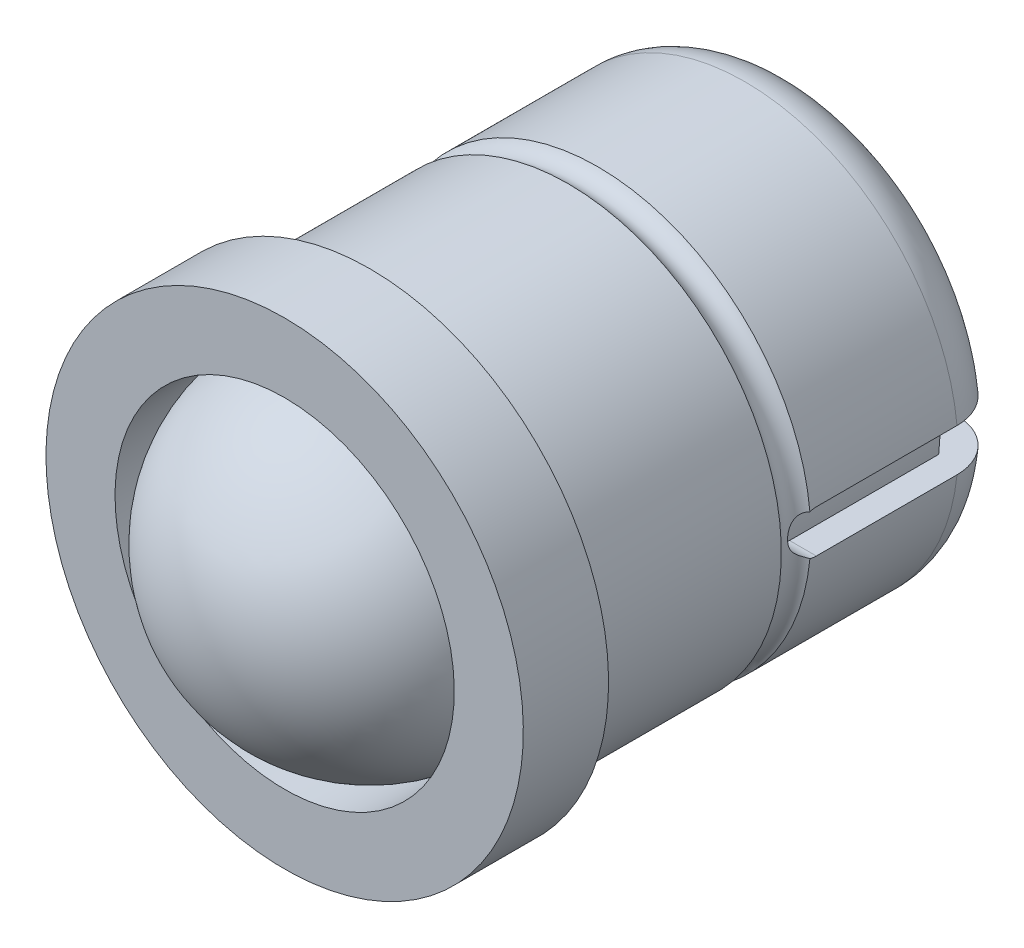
ISO-10303-21;
HEADER;
FILE_DESCRIPTION(('STEP AP214'),'2;1');
FILE_NAME('part.step','',(''),(''),'','','');
FILE_SCHEMA(('AUTOMOTIVE_DESIGN { 1 0 10303 214 1 1 1 1 }'));
ENDSEC;
DATA;
#1=APPLICATION_CONTEXT('core data for automotive mechanical design processes');
#2=APPLICATION_PROTOCOL_DEFINITION('international standard','automotive_design',2000,#1);
#3=PRODUCT_CONTEXT('',#1,'mechanical');
#4=PRODUCT('Part','Part','',(#3));
#5=PRODUCT_RELATED_PRODUCT_CATEGORY('part','',(#4));
#6=PRODUCT_DEFINITION_FORMATION('','',#4);
#7=PRODUCT_DEFINITION_CONTEXT('part definition',#1,'design');
#8=PRODUCT_DEFINITION('design','',#6,#7);
#9=PRODUCT_DEFINITION_SHAPE('','',#8);
#10=(LENGTH_UNIT() NAMED_UNIT(*) SI_UNIT(.MILLI.,.METRE.));
#11=(NAMED_UNIT(*) PLANE_ANGLE_UNIT() SI_UNIT($,.RADIAN.));
#12=(NAMED_UNIT(*) SI_UNIT($,.STERADIAN.) SOLID_ANGLE_UNIT());
#13=UNCERTAINTY_MEASURE_WITH_UNIT(LENGTH_MEASURE(1.E-05),#10,'distance_accuracy_value','');
#14=(GEOMETRIC_REPRESENTATION_CONTEXT(3) GLOBAL_UNCERTAINTY_ASSIGNED_CONTEXT((#13)) GLOBAL_UNIT_ASSIGNED_CONTEXT((#10,
#11,#12)) REPRESENTATION_CONTEXT('',''));
#15=CARTESIAN_POINT('',(0.,0.,0.));
#16=DIRECTION('',(0.,0.,1.));
#17=DIRECTION('',(1.,0.,0.));
#18=AXIS2_PLACEMENT_3D('',#15,#16,#17);
#19=CARTESIAN_POINT('',(0.,0.,1.));
#20=DIRECTION('',(0.,0.,-1.));
#21=DIRECTION('',(0.,1.,0.));
#22=AXIS2_PLACEMENT_3D('',#19,#20,#21);
#23=CYLINDRICAL_SURFACE('',#22,1.99);
#24=CARTESIAN_POINT('',(0.,0.,1.));
#25=DIRECTION('',(0.,0.,-1.));
#26=DIRECTION('',(0.,1.,0.));
#27=AXIS2_PLACEMENT_3D('',#24,#25,#26);
#28=CIRCLE('',#27,1.99);
#29=CARTESIAN_POINT('',(0.,1.99,1.));
#30=VERTEX_POINT('',#29);
#31=EDGE_CURVE('E387',#30,#30,#28,.F.);
#32=ORIENTED_EDGE('',*,*,#31,.T.);
#33=EDGE_LOOP('',(#32));
#34=FACE_BOUND('',#33,.T.);
#35=CARTESIAN_POINT('',(0.,0.,0.19974984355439));
#36=DIRECTION('',(0.,0.,-1.));
#37=DIRECTION('',(0.,1.,0.));
#38=AXIS2_PLACEMENT_3D('',#35,#36,#37);
#39=CIRCLE('',#38,1.99);
#40=CARTESIAN_POINT('',(0.,1.99,0.19974984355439));
#41=VERTEX_POINT('',#40);
#42=EDGE_CURVE('E27',#41,#41,#39,.F.);
#43=ORIENTED_EDGE('',*,*,#42,.F.);
#44=EDGE_LOOP('',(#43));
#45=FACE_BOUND('',#44,.T.);
#46=ADVANCED_FACE('F14',(#34,#45),#23,.F.);
#47=CARTESIAN_POINT('',(2.8,0.,1.));
#48=DIRECTION('',(0.,0.,-1.));
#49=DIRECTION('',(0.,1.,0.));
#50=AXIS2_PLACEMENT_3D('',#47,#48,#49);
#51=PLANE('',#50);
#52=CARTESIAN_POINT('',(0.,0.,1.));
#53=DIRECTION('',(0.,0.,-1.));
#54=DIRECTION('',(0.,1.,0.));
#55=AXIS2_PLACEMENT_3D('',#52,#53,#54);
#56=CIRCLE('',#55,2.8);
#57=CARTESIAN_POINT('',(0.,2.8,1.));
#58=VERTEX_POINT('',#57);
#59=EDGE_CURVE('E532',#58,#58,#56,.T.);
#60=ORIENTED_EDGE('',*,*,#59,.F.);
#61=EDGE_LOOP('',(#60));
#62=FACE_BOUND('',#61,.T.);
#63=ORIENTED_EDGE('',*,*,#31,.F.);
#64=EDGE_LOOP('',(#63));
#65=FACE_BOUND('',#64,.T.);
#66=ADVANCED_FACE('F16',(#62,#65),#51,.F.);
#67=CARTESIAN_POINT('',(0.,0.,1.));
#68=DIRECTION('',(0.,0.,-1.));
#69=DIRECTION('',(0.,1.,0.));
#70=AXIS2_PLACEMENT_3D('',#67,#68,#69);
#71=CYLINDRICAL_SURFACE('',#70,2.8);
#72=CARTESIAN_POINT('',(0.,0.,0.));
#73=DIRECTION('',(0.,0.,-1.));
#74=DIRECTION('',(0.,1.,0.));
#75=AXIS2_PLACEMENT_3D('',#72,#73,#74);
#76=CIRCLE('',#75,2.8);
#77=CARTESIAN_POINT('',(0.,2.8,0.));
#78=VERTEX_POINT('',#77);
#79=EDGE_CURVE('E529',#78,#78,#76,.F.);
#80=ORIENTED_EDGE('',*,*,#79,.T.);
#81=EDGE_LOOP('',(#80));
#82=FACE_BOUND('',#81,.T.);
#83=ORIENTED_EDGE('',*,*,#59,.T.);
#84=EDGE_LOOP('',(#83));
#85=FACE_BOUND('',#84,.T.);
#86=ADVANCED_FACE('F340',(#82,#85),#71,.T.);
#87=CARTESIAN_POINT('',(2.5,0.,0.));
#88=DIRECTION('',(0.,0.,1.));
#89=DIRECTION('',(0.,-1.,0.));
#90=AXIS2_PLACEMENT_3D('',#87,#88,#89);
#91=PLANE('',#90);
#92=CARTESIAN_POINT('',(0.,0.,0.));
#93=DIRECTION('',(0.,0.,-1.));
#94=DIRECTION('',(0.,1.,0.));
#95=AXIS2_PLACEMENT_3D('',#92,#93,#94);
#96=CIRCLE('',#95,2.5);
#97=CARTESIAN_POINT('',(0.,2.5,0.));
#98=VERTEX_POINT('',#97);
#99=EDGE_CURVE('E151',#98,#98,#96,.T.);
#100=ORIENTED_EDGE('',*,*,#99,.F.);
#101=EDGE_LOOP('',(#100));
#102=FACE_BOUND('',#101,.T.);
#103=ORIENTED_EDGE('',*,*,#79,.F.);
#104=EDGE_LOOP('',(#103));
#105=FACE_BOUND('',#104,.T.);
#106=ADVANCED_FACE('F497',(#102,#105),#91,.F.);
#107=CARTESIAN_POINT('',(0.,0.,1.));
#108=DIRECTION('',(0.,0.,-1.));
#109=DIRECTION('',(0.,1.,0.));
#110=AXIS2_PLACEMENT_3D('',#107,#108,#109);
#111=CYLINDRICAL_SURFACE('',#110,2.5);
#112=CARTESIAN_POINT('',(0.,0.,-2.32679491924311));
#113=DIRECTION('',(0.,0.,1.));
#114=DIRECTION('',(0.,-1.,0.));
#115=AXIS2_PLACEMENT_3D('',#112,#113,#114);
#116=CIRCLE('',#115,2.5);
#117=CARTESIAN_POINT('',(0.,-2.5,-2.32679491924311));
#118=VERTEX_POINT('',#117);
#119=EDGE_CURVE('E114',#118,#118,#116,.T.);
#120=ORIENTED_EDGE('',*,*,#119,.T.);
#121=EDGE_LOOP('',(#120));
#122=FACE_BOUND('',#121,.T.);
#123=ORIENTED_EDGE('',*,*,#99,.T.);
#124=EDGE_LOOP('',(#123));
#125=FACE_BOUND('',#124,.T.);
#126=ADVANCED_FACE('F135',(#122,#125),#111,.T.);
#127=CARTESIAN_POINT('',(0.,0.,-2.5));
#128=DIRECTION('',(0.,0.,1.));
#129=DIRECTION('',(0.,-1.,0.));
#130=AXIS2_PLACEMENT_3D('',#127,#128,#129);
#131=TOROIDAL_SURFACE('',#130,2.6,0.2);
#132=CARTESIAN_POINT('',(0.,0.,-2.6732050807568));
#133=DIRECTION('',(0.,0.,-1.));
#134=DIRECTION('',(0.,1.,0.));
#135=AXIS2_PLACEMENT_3D('',#132,#133,#134);
#136=CIRCLE('',#135,2.5);
#137=CARTESIAN_POINT('',(-2.48865374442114,0.237912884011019,-2.67320508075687));
#138=VERTEX_POINT('',#137);
#139=CARTESIAN_POINT('',(2.48865374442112,0.237912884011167,-2.67320508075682));
#140=VERTEX_POINT('',#139);
#141=EDGE_CURVE('E97',#138,#140,#136,.T.);
#142=ORIENTED_EDGE('',*,*,#141,.F.);
#143=CARTESIAN_POINT('',(-2.48865374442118,-0.237912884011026,-2.67320508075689));
#144=CARTESIAN_POINT('',(-2.48081141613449,-0.236437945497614,-2.66863685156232));
#145=CARTESIAN_POINT('',(-2.47334931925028,-0.234636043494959,-2.66350283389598));
#146=CARTESIAN_POINT('',(-2.45938144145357,-0.2302243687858,-2.65236461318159));
#147=CARTESIAN_POINT('',(-2.45287524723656,-0.227614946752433,-2.64636078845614));
#148=CARTESIAN_POINT('',(-2.44098741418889,-0.221422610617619,-2.63371815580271));
#149=CARTESIAN_POINT('',(-2.43560973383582,-0.217836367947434,-2.62707722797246));
#150=CARTESIAN_POINT('',(-2.42611141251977,-0.209633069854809,-2.61355839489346));
#151=CARTESIAN_POINT('',(-2.42198898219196,-0.205017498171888,-2.60668084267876));
#152=CARTESIAN_POINT('',(-2.41508253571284,-0.194971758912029,-2.59330467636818));
#153=CARTESIAN_POINT('',(-2.41225559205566,-0.189576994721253,-2.58680134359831));
#154=CARTESIAN_POINT('',(-2.40758309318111,-0.177951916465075,-2.57419644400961));
#155=CARTESIAN_POINT('',(-2.40573879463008,-0.171720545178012,-2.56809540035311));
#156=CARTESIAN_POINT('',(-2.40229822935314,-0.156111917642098,-2.55436494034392));
#157=CARTESIAN_POINT('',(-2.40104536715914,-0.1464229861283,-2.54700368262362));
#158=CARTESIAN_POINT('',(-2.39946465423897,-0.126024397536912,-2.53374409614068));
#159=CARTESIAN_POINT('',(-2.39913807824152,-0.115313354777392,-2.52784779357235));
#160=CARTESIAN_POINT('',(-2.39893351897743,-0.0929730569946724,-2.51760099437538));
#161=CARTESIAN_POINT('',(-2.39906257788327,-0.081332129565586,-2.51327591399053));
#162=CARTESIAN_POINT('',(-2.39941235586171,-0.0575397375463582,-2.50639648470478));
#163=CARTESIAN_POINT('',(-2.39963309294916,-0.0453881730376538,-2.50384248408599));
#164=CARTESIAN_POINT('',(-2.399953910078,-0.0192380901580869,-2.50034909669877));
#165=CARTESIAN_POINT('',(-2.40003458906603,-0.0052047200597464,-2.49966258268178));
#166=CARTESIAN_POINT('',(-2.39993333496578,0.0227852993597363,-2.50064658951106));
#167=CARTESIAN_POINT('',(-2.39975123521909,0.0367418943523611,-2.50231860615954));
#168=CARTESIAN_POINT('',(-2.399320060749,0.0641838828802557,-2.50797333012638));
#169=CARTESIAN_POINT('',(-2.39907095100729,0.0776690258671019,-2.51195724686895));
#170=CARTESIAN_POINT('',(-2.39895420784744,0.103786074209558,-2.52213069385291));
#171=CARTESIAN_POINT('',(-2.39908641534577,0.116418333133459,-2.52831930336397));
#172=CARTESIAN_POINT('',(-2.40026636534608,0.137987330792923,-2.54123236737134));
#173=CARTESIAN_POINT('',(-2.40112243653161,0.147153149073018,-2.54759185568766));
#174=CARTESIAN_POINT('',(-2.40391431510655,0.164451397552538,-2.56138051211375));
#175=CARTESIAN_POINT('',(-2.40584791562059,0.17258589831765,-2.56880747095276));
#176=CARTESIAN_POINT('',(-2.41075193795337,0.18632282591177,-2.58307222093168));
#177=CARTESIAN_POINT('',(-2.41349349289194,0.192121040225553,-2.589799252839));
#178=CARTESIAN_POINT('',(-2.42018064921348,0.202718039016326,-2.60344008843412));
#179=CARTESIAN_POINT('',(-2.42412530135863,0.207517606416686,-2.61035374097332));
#180=CARTESIAN_POINT('',(-2.43328829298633,0.216082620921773,-2.62400957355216));
#181=CARTESIAN_POINT('',(-2.43850998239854,0.219845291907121,-2.63075125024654));
#182=CARTESIAN_POINT('',(-2.45014740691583,0.226377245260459,-2.64367071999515));
#183=CARTESIAN_POINT('',(-2.45656382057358,0.229145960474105,-2.64984818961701));
#184=CARTESIAN_POINT('',(-2.46738639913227,0.232809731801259,-2.65882991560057));
#185=CARTESIAN_POINT('',(-2.47145457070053,0.233996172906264,-2.66193353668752));
#186=CARTESIAN_POINT('',(-2.47985966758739,0.236126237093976,-2.66781688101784));
#187=CARTESIAN_POINT('',(-2.48419574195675,0.237070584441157,-2.67059755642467));
#188=CARTESIAN_POINT('',(-2.48865374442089,0.237912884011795,-2.67320508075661));
#189=B_SPLINE_CURVE_WITH_KNOTS('',3,(#143,#144,#145,#146,#147,#148,#149,#150,#151,#152,#153,
#154,#155,#156,#157,#158,#159,#160,#161,#162,#163,#164,#165,#166,#167,#168,#169,#170,#171,#172,
#173,#174,#175,#176,#177,#178,#179,#180,#181,#182,#183,#184,#185,#186,#187,#188),.UNSPECIFIED.,
.F.,.F.,(4,2,2,2,2,2,2,2,2,2,2,2,2,2,2,2,2,2,2,2,2,2,4),(0.,0.0275709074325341,
0.0551298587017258,0.0827839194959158,0.11039837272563,0.137016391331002,0.163668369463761,
0.200167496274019,0.236716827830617,0.273833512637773,0.310957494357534,0.352904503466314,
0.394878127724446,0.436873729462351,0.478851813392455,0.512292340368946,0.545664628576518,
0.573428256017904,0.601170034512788,0.628985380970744,0.656816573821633,0.672554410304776,
0.688244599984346),.UNSPECIFIED.);
#190=CARTESIAN_POINT('',(-2.48865374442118,-0.237912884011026,-2.67320508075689));
#191=VERTEX_POINT('',#190);
#192=EDGE_CURVE('E106',#191,#138,#189,.T.);
#193=ORIENTED_EDGE('',*,*,#192,.F.);
#194=CARTESIAN_POINT('',(0.,0.,-2.6732050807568));
#195=DIRECTION('',(0.,0.,-1.));
#196=DIRECTION('',(0.,1.,0.));
#197=AXIS2_PLACEMENT_3D('',#194,#195,#196);
#198=CIRCLE('',#197,2.5);
#199=CARTESIAN_POINT('',(2.48865374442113,-0.237912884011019,-2.67320508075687));
#200=VERTEX_POINT('',#199);
#201=EDGE_CURVE('E224',#200,#191,#198,.T.);
#202=ORIENTED_EDGE('',*,*,#201,.F.);
#203=CARTESIAN_POINT('',(2.4886537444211,0.237912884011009,-2.67320508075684));
#204=CARTESIAN_POINT('',(2.48081141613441,0.236437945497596,-2.66863685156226));
#205=CARTESIAN_POINT('',(2.4733493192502,0.234636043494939,-2.66350283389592));
#206=CARTESIAN_POINT('',(2.4593814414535,0.230224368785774,-2.65236461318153));
#207=CARTESIAN_POINT('',(2.45287524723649,0.227614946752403,-2.64636078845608));
#208=CARTESIAN_POINT('',(2.44098741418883,0.221422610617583,-2.63371815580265));
#209=CARTESIAN_POINT('',(2.43560973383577,0.217836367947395,-2.62707722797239));
#210=CARTESIAN_POINT('',(2.42611141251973,0.209633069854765,-2.61355839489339));
#211=CARTESIAN_POINT('',(2.42198898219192,0.205017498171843,-2.60668084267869));
#212=CARTESIAN_POINT('',(2.41508253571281,0.194971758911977,-2.59330467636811));
#213=CARTESIAN_POINT('',(2.41225559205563,0.189576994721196,-2.58680134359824));
#214=CARTESIAN_POINT('',(2.40758309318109,0.177951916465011,-2.57419644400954));
#215=CARTESIAN_POINT('',(2.40573879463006,0.171720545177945,-2.56809540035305));
#216=CARTESIAN_POINT('',(2.40229822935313,0.156111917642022,-2.55436494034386));
#217=CARTESIAN_POINT('',(2.40104536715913,0.146422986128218,-2.54700368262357));
#218=CARTESIAN_POINT('',(2.39946465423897,0.126024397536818,-2.53374409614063));
#219=CARTESIAN_POINT('',(2.39913807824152,0.115313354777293,-2.52784779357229));
#220=CARTESIAN_POINT('',(2.39893351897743,0.0929730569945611,-2.51760099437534));
#221=CARTESIAN_POINT('',(2.39906257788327,0.0813321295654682,-2.51327591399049));
#222=CARTESIAN_POINT('',(2.39941235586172,0.0575397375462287,-2.50639648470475));
#223=CARTESIAN_POINT('',(2.39963309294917,0.0453881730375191,-2.50384248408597));
#224=CARTESIAN_POINT('',(2.399953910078,0.0192380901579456,-2.50034909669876));
#225=CARTESIAN_POINT('',(2.40003458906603,0.0052047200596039,-2.49966258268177));
#226=CARTESIAN_POINT('',(2.39993333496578,-0.0227852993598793,-2.50064658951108));
#227=CARTESIAN_POINT('',(2.39975123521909,-0.0367418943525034,-2.50231860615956));
#228=CARTESIAN_POINT('',(2.399320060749,-0.0641838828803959,-2.50797333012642));
#229=CARTESIAN_POINT('',(2.39907095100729,-0.0776690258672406,-2.51195724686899));
#230=CARTESIAN_POINT('',(2.39895420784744,-0.10378607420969,-2.52213069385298));
#231=CARTESIAN_POINT('',(2.39908641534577,-0.116418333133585,-2.52831930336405));
#232=CARTESIAN_POINT('',(2.40026636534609,-0.137987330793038,-2.54123236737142));
#233=CARTESIAN_POINT('',(2.40112243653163,-0.147153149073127,-2.54759185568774));
#234=CARTESIAN_POINT('',(2.40391431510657,-0.16445139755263,-2.56138051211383));
#235=CARTESIAN_POINT('',(2.40584791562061,-0.172585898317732,-2.56880747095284));
#236=CARTESIAN_POINT('',(2.4107519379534,-0.186322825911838,-2.58307222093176));
#237=CARTESIAN_POINT('',(2.41349349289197,-0.192121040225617,-2.58979925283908));
#238=CARTESIAN_POINT('',(2.42018064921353,-0.202718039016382,-2.60344008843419));
#239=CARTESIAN_POINT('',(2.42412530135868,-0.207517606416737,-2.6103537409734));
#240=CARTESIAN_POINT('',(2.43328829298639,-0.216082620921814,-2.62400957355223));
#241=CARTESIAN_POINT('',(2.4385099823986,-0.219845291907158,-2.63075125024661));
#242=CARTESIAN_POINT('',(2.4501474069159,-0.226377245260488,-2.64367071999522));
#243=CARTESIAN_POINT('',(2.45656382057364,-0.229145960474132,-2.64984818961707));
#244=CARTESIAN_POINT('',(2.46738639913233,-0.232809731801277,-2.65882991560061));
#245=CARTESIAN_POINT('',(2.47145457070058,-0.233996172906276,-2.66193353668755));
#246=CARTESIAN_POINT('',(2.47985966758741,-0.236126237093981,-2.66781688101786));
#247=CARTESIAN_POINT('',(2.48419574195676,-0.237070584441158,-2.67059755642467));
#248=CARTESIAN_POINT('',(2.48865374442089,-0.237912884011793,-2.67320508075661));
#249=B_SPLINE_CURVE_WITH_KNOTS('',3,(#203,#204,#205,#206,#207,#208,#209,#210,#211,#212,#213,
#214,#215,#216,#217,#218,#219,#220,#221,#222,#223,#224,#225,#226,#227,#228,#229,#230,#231,#232,
#233,#234,#235,#236,#237,#238,#239,#240,#241,#242,#243,#244,#245,#246,#247,#248),.UNSPECIFIED.,
.F.,.F.,(4,2,2,2,2,2,2,2,2,2,2,2,2,2,2,2,2,2,2,2,2,2,4),(0.,0.0275709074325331,
0.0551298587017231,0.0827839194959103,0.110398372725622,0.137016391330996,0.163668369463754,
0.200167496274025,0.236716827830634,0.273833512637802,0.310957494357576,0.352904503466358,
0.394878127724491,0.436873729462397,0.478851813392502,0.512292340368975,0.54566462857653,
0.573428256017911,0.601170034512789,0.628985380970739,0.656816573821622,0.67255441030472,
0.688244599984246),.UNSPECIFIED.);
#250=EDGE_CURVE('E113',#140,#200,#249,.T.);
#251=ORIENTED_EDGE('',*,*,#250,.F.);
#252=EDGE_LOOP('',(#142,#193,#202,#251));
#253=FACE_BOUND('',#252,.T.);
#254=ORIENTED_EDGE('',*,*,#119,.F.);
#255=EDGE_LOOP('',(#254));
#256=FACE_BOUND('',#255,.T.);
#257=ADVANCED_FACE('F116',(#253,#256),#131,.F.);
#258=CARTESIAN_POINT('',(0.,0.,1.));
#259=DIRECTION('',(0.,0.,-1.));
#260=DIRECTION('',(0.,1.,0.));
#261=AXIS2_PLACEMENT_3D('',#258,#259,#260);
#262=CYLINDRICAL_SURFACE('',#261,2.5);
#263=DIRECTION('',(0.,0.,-1.));
#264=VECTOR('',#263,1.);
#265=CARTESIAN_POINT('',(2.48746859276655,0.25,1.));
#266=LINE('',#265,#264);
#267=CARTESIAN_POINT('',(2.48746859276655,0.25,-2.75));
#268=VERTEX_POINT('',#267);
#269=CARTESIAN_POINT('',(2.48746859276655,0.25,-4.4));
#270=VERTEX_POINT('',#269);
#271=EDGE_CURVE('E121',#268,#270,#266,.T.);
#272=ORIENTED_EDGE('',*,*,#271,.T.);
#273=CARTESIAN_POINT('',(0.,0.,-4.4));
#274=DIRECTION('',(0.,0.,1.));
#275=DIRECTION('',(0.,-1.,0.));
#276=AXIS2_PLACEMENT_3D('',#273,#274,#275);
#277=CIRCLE('',#276,2.5);
#278=CARTESIAN_POINT('',(-2.48746859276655,0.25,-4.4));
#279=VERTEX_POINT('',#278);
#280=EDGE_CURVE('E212',#279,#270,#277,.F.);
#281=ORIENTED_EDGE('',*,*,#280,.F.);
#282=DIRECTION('',(0.,0.,-1.));
#283=VECTOR('',#282,1.);
#284=CARTESIAN_POINT('',(-2.48746859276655,0.25,1.));
#285=LINE('',#284,#283);
#286=CARTESIAN_POINT('',(-2.48746859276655,0.25,-2.75));
#287=VERTEX_POINT('',#286);
#288=EDGE_CURVE('E101',#279,#287,#285,.F.);
#289=ORIENTED_EDGE('',*,*,#288,.T.);
#290=CARTESIAN_POINT('',(-2.48746859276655,0.25,-2.75));
#291=CARTESIAN_POINT('',(-2.48747356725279,0.249987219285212,-2.73688281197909));
#292=CARTESIAN_POINT('',(-2.48757481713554,0.248973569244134,-2.72392464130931));
#293=CARTESIAN_POINT('',(-2.48796986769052,0.244944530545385,-2.69832633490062));
#294=CARTESIAN_POINT('',(-2.48826366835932,0.241929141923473,-2.68568619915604));
#295=CARTESIAN_POINT('',(-2.48865374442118,0.237912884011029,-2.67320508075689));
#296=B_SPLINE_CURVE_WITH_KNOTS('',3,(#290,#291,#292,#293,#294,#295),.UNSPECIFIED.,.F.,.F.,(4,2,
4),(0.,0.0389944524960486,0.077988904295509),.UNSPECIFIED.);
#297=EDGE_CURVE('E93',#287,#138,#296,.T.);
#298=ORIENTED_EDGE('',*,*,#297,.T.);
#299=ORIENTED_EDGE('',*,*,#141,.T.);
#300=CARTESIAN_POINT('',(2.48865374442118,0.237912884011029,-2.67320508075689));
#301=CARTESIAN_POINT('',(2.48826366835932,0.241929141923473,-2.68568619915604));
#302=CARTESIAN_POINT('',(2.48796986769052,0.244944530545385,-2.69832633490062));
#303=CARTESIAN_POINT('',(2.48757481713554,0.248973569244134,-2.72392464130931));
#304=CARTESIAN_POINT('',(2.48747356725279,0.249987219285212,-2.73688281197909));
#305=CARTESIAN_POINT('',(2.48746859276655,0.25,-2.75));
#306=B_SPLINE_CURVE_WITH_KNOTS('',3,(#300,#301,#302,#303,#304,#305),.UNSPECIFIED.,.F.,.F.,(4,2,
4),(0.,0.0389944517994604,0.077988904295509),.UNSPECIFIED.);
#307=EDGE_CURVE('E119',#140,#268,#306,.T.);
#308=ORIENTED_EDGE('',*,*,#307,.T.);
#309=EDGE_LOOP('',(#272,#281,#289,#298,#299,#308));
#310=FACE_BOUND('',#309,.T.);
#311=ADVANCED_FACE('F95',(#310),#262,.T.);
#312=CARTESIAN_POINT('',(0.,0.,1.));
#313=DIRECTION('',(0.,0.,-1.));
#314=DIRECTION('',(0.,1.,0.));
#315=AXIS2_PLACEMENT_3D('',#312,#313,#314);
#316=CYLINDRICAL_SURFACE('',#315,2.5);
#317=CARTESIAN_POINT('',(2.48746859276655,-0.25,-2.75));
#318=CARTESIAN_POINT('',(2.48747356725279,-0.249987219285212,-2.73688281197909));
#319=CARTESIAN_POINT('',(2.48757481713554,-0.248973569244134,-2.72392464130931));
#320=CARTESIAN_POINT('',(2.48796986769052,-0.244944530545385,-2.69832633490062));
#321=CARTESIAN_POINT('',(2.48826366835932,-0.241929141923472,-2.68568619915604));
#322=CARTESIAN_POINT('',(2.48865374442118,-0.237912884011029,-2.67320508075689));
#323=B_SPLINE_CURVE_WITH_KNOTS('',3,(#317,#318,#319,#320,#321,#322),.UNSPECIFIED.,.F.,.F.,(4,2,
4),(0.,0.0389944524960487,0.077988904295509),.UNSPECIFIED.);
#324=CARTESIAN_POINT('',(2.48746859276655,-0.25,-2.75));
#325=VERTEX_POINT('',#324);
#326=EDGE_CURVE('E177',#325,#200,#323,.T.);
#327=ORIENTED_EDGE('',*,*,#326,.T.);
#328=ORIENTED_EDGE('',*,*,#201,.T.);
#329=CARTESIAN_POINT('',(-2.48865374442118,-0.237912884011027,-2.67320508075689));
#330=CARTESIAN_POINT('',(-2.48826366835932,-0.241929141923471,-2.68568619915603));
#331=CARTESIAN_POINT('',(-2.48796986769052,-0.244944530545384,-2.69832633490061));
#332=CARTESIAN_POINT('',(-2.48757481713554,-0.248973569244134,-2.7239246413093));
#333=CARTESIAN_POINT('',(-2.48747356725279,-0.249987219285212,-2.73688281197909));
#334=CARTESIAN_POINT('',(-2.48746859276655,-0.25,-2.75));
#335=B_SPLINE_CURVE_WITH_KNOTS('',3,(#329,#330,#331,#332,#333,#334),.UNSPECIFIED.,.F.,.F.,(4,2,
4),(0.,0.0389944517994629,0.0779889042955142),.UNSPECIFIED.);
#336=CARTESIAN_POINT('',(-2.48746859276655,-0.25,-2.75));
#337=VERTEX_POINT('',#336);
#338=EDGE_CURVE('E109',#191,#337,#335,.T.);
#339=ORIENTED_EDGE('',*,*,#338,.T.);
#340=DIRECTION('',(0.,0.,-1.));
#341=VECTOR('',#340,1.);
#342=CARTESIAN_POINT('',(-2.48746859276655,-0.25,1.));
#343=LINE('',#342,#341);
#344=CARTESIAN_POINT('',(-2.48746859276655,-0.25,-4.4));
#345=VERTEX_POINT('',#344);
#346=EDGE_CURVE('E176',#337,#345,#343,.T.);
#347=ORIENTED_EDGE('',*,*,#346,.T.);
#348=CARTESIAN_POINT('',(0.,0.,-4.4));
#349=DIRECTION('',(0.,0.,1.));
#350=DIRECTION('',(0.,-1.,0.));
#351=AXIS2_PLACEMENT_3D('',#348,#349,#350);
#352=CIRCLE('',#351,2.5);
#353=CARTESIAN_POINT('',(2.48746859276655,-0.25,-4.4));
#354=VERTEX_POINT('',#353);
#355=EDGE_CURVE('E235',#354,#345,#352,.F.);
#356=ORIENTED_EDGE('',*,*,#355,.F.);
#357=DIRECTION('',(0.,0.,-1.));
#358=VECTOR('',#357,1.);
#359=CARTESIAN_POINT('',(2.48746859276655,-0.25,1.));
#360=LINE('',#359,#358);
#361=EDGE_CURVE('E231',#354,#325,#360,.F.);
#362=ORIENTED_EDGE('',*,*,#361,.T.);
#363=EDGE_LOOP('',(#327,#328,#339,#347,#356,#362));
#364=FACE_BOUND('',#363,.T.);
#365=ADVANCED_FACE('F187',(#364),#316,.T.);
#366=CARTESIAN_POINT('',(0.,0.,-4.4));
#367=DIRECTION('',(0.,0.,1.));
#368=DIRECTION('',(0.,-1.,0.));
#369=AXIS2_PLACEMENT_3D('',#366,#367,#368);
#370=TOROIDAL_SURFACE('',#369,1.9,0.6);
#371=ORIENTED_EDGE('',*,*,#280,.T.);
#372=CARTESIAN_POINT('',(2.48746859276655,0.25,-4.4));
#373=CARTESIAN_POINT('',(2.48749780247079,0.25,-4.43362312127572));
#374=CARTESIAN_POINT('',(2.48462984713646,0.25,-4.46723690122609));
#375=CARTESIAN_POINT('',(2.47331604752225,0.25,-4.53348232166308));
#376=CARTESIAN_POINT('',(2.46487526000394,0.25,-4.56611482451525));
#377=CARTESIAN_POINT('',(2.44262660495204,0.25,-4.62951255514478));
#378=CARTESIAN_POINT('',(2.42881636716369,0.25,-4.66027695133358));
#379=CARTESIAN_POINT('',(2.39624018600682,0.25,-4.71905214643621));
#380=CARTESIAN_POINT('',(2.37747495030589,0.25,-4.74706333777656));
#381=CARTESIAN_POINT('',(2.33548491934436,0.25,-4.79960399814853));
#382=CARTESIAN_POINT('',(2.3122516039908,0.25,-4.82412665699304));
#383=CARTESIAN_POINT('',(2.26201436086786,0.25,-4.86894620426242));
#384=CARTESIAN_POINT('',(2.23501031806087,0.25,-4.8892429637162));
#385=CARTESIAN_POINT('',(2.17785793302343,0.25,-4.92514625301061));
#386=CARTESIAN_POINT('',(2.14769434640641,0.25,-4.94072848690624));
#387=CARTESIAN_POINT('',(2.08519545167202,0.25,-4.96663862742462));
#388=CARTESIAN_POINT('',(2.05286114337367,0.25,-4.97696893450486));
#389=CARTESIAN_POINT('',(1.99754117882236,0.25,-4.98968088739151));
#390=CARTESIAN_POINT('',(1.97488552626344,0.25,-4.99354951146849));
#391=CARTESIAN_POINT('',(1.92931630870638,0.25,-4.99870882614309));
#392=CARTESIAN_POINT('',(1.90640317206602,0.25,-5.00000330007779));
#393=CARTESIAN_POINT('',(1.8834808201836,0.25,-5.));
#394=B_SPLINE_CURVE_WITH_KNOTS('',3,(#372,#373,#374,#375,#376,#377,#378,#379,#380,#381,#382,
#383,#384,#385,#386,#387,#388,#389,#390,#391,#392,#393),.UNSPECIFIED.,.F.,.F.,(4,2,2,2,2,2,2,2,
2,2,4),(0.,0.100733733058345,0.201376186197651,0.302063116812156,0.402735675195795,
0.503602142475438,0.604471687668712,0.705852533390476,0.807187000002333,0.876000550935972,
0.944712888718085),.UNSPECIFIED.);
#395=CARTESIAN_POINT('',(1.8834808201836,0.25,-5.));
#396=VERTEX_POINT('',#395);
#397=EDGE_CURVE('E215',#270,#396,#394,.T.);
#398=ORIENTED_EDGE('',*,*,#397,.T.);
#399=CARTESIAN_POINT('',(0.,0.,-5.));
#400=DIRECTION('',(0.,0.,1.));
#401=DIRECTION('',(0.991305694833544,0.131578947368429,0.));
#402=AXIS2_PLACEMENT_3D('',#399,#400,#401);
#403=CIRCLE('',#402,1.89999999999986);
#404=CARTESIAN_POINT('',(-1.88348082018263,0.250000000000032,-5.));
#405=VERTEX_POINT('',#404);
#406=EDGE_CURVE('E219',#396,#405,#403,.T.);
#407=ORIENTED_EDGE('',*,*,#406,.T.);
#408=CARTESIAN_POINT('',(-1.88348082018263,0.25,-5.));
#409=CARTESIAN_POINT('',(-1.91764824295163,0.25,-5.00002872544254));
#410=CARTESIAN_POINT('',(-1.95181078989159,0.25,-4.9971335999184));
#411=CARTESIAN_POINT('',(-2.01915814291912,0.25,-4.98568725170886));
#412=CARTESIAN_POINT('',(-2.05234342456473,0.25,-4.97713882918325));
#413=CARTESIAN_POINT('',(-2.11682488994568,0.25,-4.95456982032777));
#414=CARTESIAN_POINT('',(-2.1481198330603,0.25,-4.94054568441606));
#415=CARTESIAN_POINT('',(-2.20788598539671,0.25,-4.9074207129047));
#416=CARTESIAN_POINT('',(-2.23635797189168,0.25,-4.88832128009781));
#417=CARTESIAN_POINT('',(-2.28952196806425,0.25,-4.84568390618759));
#418=CARTESIAN_POINT('',(-2.31423231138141,0.25,-4.82216882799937));
#419=CARTESIAN_POINT('',(-2.35932300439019,0.25,-4.77130085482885));
#420=CARTESIAN_POINT('',(-2.37970364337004,0.25,-4.74394821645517));
#421=CARTESIAN_POINT('',(-2.41543095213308,0.25,-4.6863604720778));
#422=CARTESIAN_POINT('',(-2.43080669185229,0.25,-4.65614337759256));
#423=CARTESIAN_POINT('',(-2.45623337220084,0.25,-4.59355600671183));
#424=CARTESIAN_POINT('',(-2.46628785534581,0.25,-4.56118717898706));
#425=CARTESIAN_POINT('',(-2.47816764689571,0.25,-4.50716832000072));
#426=CARTESIAN_POINT('',(-2.4816535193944,0.250000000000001,-4.48586900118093));
#427=CARTESIAN_POINT('',(-2.48630353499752,0.249999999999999,-4.44304954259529));
#428=CARTESIAN_POINT('',(-2.48747101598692,0.249999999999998,-4.42152976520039));
#429=CARTESIAN_POINT('',(-2.48746859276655,0.249999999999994,-4.4));
#430=B_SPLINE_CURVE_WITH_KNOTS('',3,(#408,#409,#410,#411,#412,#413,#414,#415,#416,#417,#418,
#419,#420,#421,#422,#423,#424,#425,#426,#427,#428,#429),.UNSPECIFIED.,.F.,.F.,(4,2,2,2,2,2,2,2,
2,2,4),(0.,0.102373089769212,0.204695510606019,0.307084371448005,0.409444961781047,
0.511289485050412,0.61312720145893,0.714362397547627,0.8155301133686,0.880161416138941,
0.94469959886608),.UNSPECIFIED.);
#431=EDGE_CURVE('E216',#405,#279,#430,.T.);
#432=ORIENTED_EDGE('',*,*,#431,.T.);
#433=EDGE_LOOP('',(#371,#398,#407,#432));
#434=FACE_BOUND('',#433,.T.);
#435=ADVANCED_FACE('F191',(#434),#370,.T.);
#436=CARTESIAN_POINT('',(0.,0.,-4.4));
#437=DIRECTION('',(0.,0.,1.));
#438=DIRECTION('',(0.,-1.,0.));
#439=AXIS2_PLACEMENT_3D('',#436,#437,#438);
#440=TOROIDAL_SURFACE('',#439,1.9,0.6);
#441=CARTESIAN_POINT('',(0.,0.,-5.));
#442=DIRECTION('',(0.,0.,1.));
#443=DIRECTION('',(-0.991305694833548,-0.131578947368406,0.));
#444=AXIS2_PLACEMENT_3D('',#441,#442,#443);
#445=CIRCLE('',#444,1.90000000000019);
#446=CARTESIAN_POINT('',(-1.88348082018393,-0.25,-5.));
#447=VERTEX_POINT('',#446);
#448=CARTESIAN_POINT('',(1.88348082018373,-0.250000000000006,-5.));
#449=VERTEX_POINT('',#448);
#450=EDGE_CURVE('E315',#447,#449,#445,.T.);
#451=ORIENTED_EDGE('',*,*,#450,.T.);
#452=CARTESIAN_POINT('',(1.88348082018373,-0.25,-5.));
#453=CARTESIAN_POINT('',(1.91764824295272,-0.25,-5.00002872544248));
#454=CARTESIAN_POINT('',(1.95181078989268,-0.25,-4.99713359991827));
#455=CARTESIAN_POINT('',(2.01915814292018,-0.25,-4.98568725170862));
#456=CARTESIAN_POINT('',(2.05234342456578,-0.25,-4.97713882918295));
#457=CARTESIAN_POINT('',(2.11682488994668,-0.25,-4.95456982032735));
#458=CARTESIAN_POINT('',(2.14811983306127,-0.25,-4.94054568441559));
#459=CARTESIAN_POINT('',(2.20788598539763,-0.25,-4.90742071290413));
#460=CARTESIAN_POINT('',(2.23635797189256,-0.25,-4.88832128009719));
#461=CARTESIAN_POINT('',(2.28952196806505,-0.25,-4.84568390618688));
#462=CARTESIAN_POINT('',(2.31423231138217,-0.25,-4.82216882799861));
#463=CARTESIAN_POINT('',(2.35932300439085,-0.25,-4.77130085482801));
#464=CARTESIAN_POINT('',(2.37970364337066,-0.25,-4.74394821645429));
#465=CARTESIAN_POINT('',(2.4154309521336,-0.25,-4.68636047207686));
#466=CARTESIAN_POINT('',(2.43080669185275,-0.25,-4.6561433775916));
#467=CARTESIAN_POINT('',(2.45623337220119,-0.25,-4.59355600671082));
#468=CARTESIAN_POINT('',(2.46628785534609,-0.25,-4.56118717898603));
#469=CARTESIAN_POINT('',(2.47816764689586,-0.25,-4.50716831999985));
#470=CARTESIAN_POINT('',(2.48165351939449,-0.250000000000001,-4.48586900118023));
#471=CARTESIAN_POINT('',(2.48630353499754,-0.249999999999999,-4.44304954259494));
#472=CARTESIAN_POINT('',(2.48747101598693,-0.249999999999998,-4.42152976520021));
#473=CARTESIAN_POINT('',(2.48746859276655,-0.249999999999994,-4.4));
#474=B_SPLINE_CURVE_WITH_KNOTS('',3,(#452,#453,#454,#455,#456,#457,#458,#459,#460,#461,#462,
#463,#464,#465,#466,#467,#468,#469,#470,#471,#472,#473),.UNSPECIFIED.,.F.,.F.,(4,2,2,2,2,2,2,2,
2,2,4),(0.,0.102373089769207,0.20469551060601,0.30708437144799,0.409444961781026,
0.511289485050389,0.613127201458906,0.7143623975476,0.815530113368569,0.880161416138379,
0.944699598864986),.UNSPECIFIED.);
#475=EDGE_CURVE('E239',#449,#354,#474,.T.);
#476=ORIENTED_EDGE('',*,*,#475,.T.);
#477=ORIENTED_EDGE('',*,*,#355,.T.);
#478=CARTESIAN_POINT('',(-2.48746859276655,-0.25,-4.4));
#479=CARTESIAN_POINT('',(-2.48749780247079,-0.25,-4.43362312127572));
#480=CARTESIAN_POINT('',(-2.48462984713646,-0.25,-4.46723690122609));
#481=CARTESIAN_POINT('',(-2.47331604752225,-0.25,-4.53348232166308));
#482=CARTESIAN_POINT('',(-2.46487526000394,-0.25,-4.56611482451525));
#483=CARTESIAN_POINT('',(-2.44262660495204,-0.25,-4.62951255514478));
#484=CARTESIAN_POINT('',(-2.42881636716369,-0.25,-4.66027695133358));
#485=CARTESIAN_POINT('',(-2.39624018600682,-0.25,-4.71905214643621));
#486=CARTESIAN_POINT('',(-2.37747495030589,-0.25,-4.74706333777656));
#487=CARTESIAN_POINT('',(-2.33548491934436,-0.25,-4.79960399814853));
#488=CARTESIAN_POINT('',(-2.3122516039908,-0.25,-4.82412665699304));
#489=CARTESIAN_POINT('',(-2.26201436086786,-0.25,-4.86894620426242));
#490=CARTESIAN_POINT('',(-2.23501031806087,-0.25,-4.8892429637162));
#491=CARTESIAN_POINT('',(-2.17785793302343,-0.25,-4.92514625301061));
#492=CARTESIAN_POINT('',(-2.14769434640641,-0.25,-4.94072848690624));
#493=CARTESIAN_POINT('',(-2.08519545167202,-0.25,-4.96663862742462));
#494=CARTESIAN_POINT('',(-2.05286114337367,-0.25,-4.97696893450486));
#495=CARTESIAN_POINT('',(-1.99754117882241,-0.25,-4.9896808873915));
#496=CARTESIAN_POINT('',(-1.97488552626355,-0.25,-4.99354951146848));
#497=CARTESIAN_POINT('',(-1.9293163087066,-0.25,-4.99870882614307));
#498=CARTESIAN_POINT('',(-1.9064031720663,-0.25,-5.00000330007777));
#499=CARTESIAN_POINT('',(-1.88348082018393,-0.25,-5.));
#500=B_SPLINE_CURVE_WITH_KNOTS('',3,(#478,#479,#480,#481,#482,#483,#484,#485,#486,#487,#488,
#489,#490,#491,#492,#493,#494,#495,#496,#497,#498,#499),.UNSPECIFIED.,.F.,.F.,(4,2,2,2,2,2,2,2,
2,2,4),(0.,0.100733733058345,0.201376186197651,0.302063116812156,0.402735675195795,
0.503602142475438,0.604471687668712,0.705852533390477,0.807187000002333,0.876000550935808,
0.944712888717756),.UNSPECIFIED.);
#501=EDGE_CURVE('E42',#345,#447,#500,.T.);
#502=ORIENTED_EDGE('',*,*,#501,.T.);
#503=EDGE_LOOP('',(#451,#476,#477,#502));
#504=FACE_BOUND('',#503,.T.);
#505=ADVANCED_FACE('F198',(#504),#440,.T.);
#506=CARTESIAN_POINT('',(0.,0.,-5.));
#507=DIRECTION('',(0.,0.,1.));
#508=DIRECTION('',(0.,-1.,0.));
#509=AXIS2_PLACEMENT_3D('',#506,#507,#508);
#510=PLANE('',#509);
#511=ORIENTED_EDGE('',*,*,#406,.F.);
#512=DIRECTION('',(1.,0.,0.));
#513=VECTOR('',#512,1.);
#514=CARTESIAN_POINT('',(2.8,0.25,-5.));
#515=LINE('',#514,#513);
#516=EDGE_CURVE('E299',#405,#396,#515,.T.);
#517=ORIENTED_EDGE('',*,*,#516,.F.);
#518=EDGE_LOOP('',(#511,#517));
#519=FACE_BOUND('',#518,.T.);
#520=ADVANCED_FACE('F281',(#519),#510,.F.);
#521=CARTESIAN_POINT('',(0.,0.,-5.));
#522=DIRECTION('',(0.,0.,1.));
#523=DIRECTION('',(0.,-1.,0.));
#524=AXIS2_PLACEMENT_3D('',#521,#522,#523);
#525=PLANE('',#524);
#526=ORIENTED_EDGE('',*,*,#450,.F.);
#527=DIRECTION('',(1.,0.,0.));
#528=VECTOR('',#527,1.);
#529=CARTESIAN_POINT('',(2.8,-0.25,-5.));
#530=LINE('',#529,#528);
#531=EDGE_CURVE('E244',#449,#447,#530,.F.);
#532=ORIENTED_EDGE('',*,*,#531,.F.);
#533=EDGE_LOOP('',(#526,#532));
#534=FACE_BOUND('',#533,.T.);
#535=ADVANCED_FACE('F271',(#534),#525,.F.);
#536=CARTESIAN_POINT('',(2.8,0.25,-5.));
#537=DIRECTION('',(0.,-1.,0.));
#538=DIRECTION('',(0.,0.,-1.));
#539=AXIS2_PLACEMENT_3D('',#536,#537,#538);
#540=PLANE('',#539);
#541=DIRECTION('',(1.,0.,0.));
#542=VECTOR('',#541,1.);
#543=CARTESIAN_POINT('',(1.79,0.25,-4.5));
#544=LINE('',#543,#542);
#545=CARTESIAN_POINT('',(2.17270536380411,0.25,-4.5));
#546=VERTEX_POINT('',#545);
#547=CARTESIAN_POINT('',(-2.17270536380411,0.25,-4.5));
#548=VERTEX_POINT('',#547);
#549=EDGE_CURVE('E317',#546,#548,#544,.F.);
#550=ORIENTED_EDGE('',*,*,#549,.T.);
#551=DIRECTION('',(0.,0.,-1.));
#552=VECTOR('',#551,1.);
#553=CARTESIAN_POINT('',(-2.17270536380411,0.25,-4.5));
#554=LINE('',#553,#552);
#555=CARTESIAN_POINT('',(-2.17270536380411,0.25,-2.75));
#556=VERTEX_POINT('',#555);
#557=EDGE_CURVE('E365',#556,#548,#554,.T.);
#558=ORIENTED_EDGE('',*,*,#557,.F.);
#559=DIRECTION('',(1.,0.,0.));
#560=VECTOR('',#559,1.);
#561=CARTESIAN_POINT('',(2.8,0.25,-2.75));
#562=LINE('',#561,#560);
#563=EDGE_CURVE('E306',#556,#287,#562,.F.);
#564=ORIENTED_EDGE('',*,*,#563,.T.);
#565=ORIENTED_EDGE('',*,*,#288,.F.);
#566=ORIENTED_EDGE('',*,*,#431,.F.);
#567=ORIENTED_EDGE('',*,*,#516,.T.);
#568=ORIENTED_EDGE('',*,*,#397,.F.);
#569=ORIENTED_EDGE('',*,*,#271,.F.);
#570=DIRECTION('',(1.,0.,0.));
#571=VECTOR('',#570,1.);
#572=CARTESIAN_POINT('',(2.8,0.25,-2.75));
#573=LINE('',#572,#571);
#574=CARTESIAN_POINT('',(2.17270536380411,0.25,-2.75));
#575=VERTEX_POINT('',#574);
#576=EDGE_CURVE('E313',#268,#575,#573,.F.);
#577=ORIENTED_EDGE('',*,*,#576,.T.);
#578=DIRECTION('',(0.,0.,-1.));
#579=VECTOR('',#578,1.);
#580=CARTESIAN_POINT('',(2.17270536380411,0.25,-4.5));
#581=LINE('',#580,#579);
#582=EDGE_CURVE('E34',#546,#575,#581,.F.);
#583=ORIENTED_EDGE('',*,*,#582,.F.);
#584=EDGE_LOOP('',(#550,#558,#564,#565,#566,#567,#568,#569,#577,#583));
#585=FACE_BOUND('',#584,.T.);
#586=ADVANCED_FACE('F267',(#585),#540,.T.);
#587=CARTESIAN_POINT('',(2.8,-0.25,-2.75));
#588=DIRECTION('',(0.,1.,0.));
#589=DIRECTION('',(0.,0.,1.));
#590=AXIS2_PLACEMENT_3D('',#587,#588,#589);
#591=PLANE('',#590);
#592=DIRECTION('',(1.,0.,0.));
#593=VECTOR('',#592,1.);
#594=CARTESIAN_POINT('',(1.79,-0.25,-4.5));
#595=LINE('',#594,#593);
#596=CARTESIAN_POINT('',(-2.17270536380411,-0.25,-4.5));
#597=VERTEX_POINT('',#596);
#598=CARTESIAN_POINT('',(2.17270536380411,-0.25,-4.5));
#599=VERTEX_POINT('',#598);
#600=EDGE_CURVE('E320',#597,#599,#595,.T.);
#601=ORIENTED_EDGE('',*,*,#600,.T.);
#602=DIRECTION('',(0.,0.,-1.));
#603=VECTOR('',#602,1.);
#604=CARTESIAN_POINT('',(2.17270536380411,-0.25,-4.5));
#605=LINE('',#604,#603);
#606=CARTESIAN_POINT('',(2.17270536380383,-0.250000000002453,-2.75));
#607=VERTEX_POINT('',#606);
#608=EDGE_CURVE('E362',#607,#599,#605,.T.);
#609=ORIENTED_EDGE('',*,*,#608,.F.);
#610=DIRECTION('',(1.,0.,0.));
#611=VECTOR('',#610,1.);
#612=CARTESIAN_POINT('',(2.8,-0.25,-2.75));
#613=LINE('',#612,#611);
#614=EDGE_CURVE('E290',#607,#325,#613,.T.);
#615=ORIENTED_EDGE('',*,*,#614,.T.);
#616=ORIENTED_EDGE('',*,*,#361,.F.);
#617=ORIENTED_EDGE('',*,*,#475,.F.);
#618=ORIENTED_EDGE('',*,*,#531,.T.);
#619=ORIENTED_EDGE('',*,*,#501,.F.);
#620=ORIENTED_EDGE('',*,*,#346,.F.);
#621=DIRECTION('',(1.,0.,0.));
#622=VECTOR('',#621,1.);
#623=CARTESIAN_POINT('',(2.8,-0.25,-2.75));
#624=LINE('',#623,#622);
#625=CARTESIAN_POINT('',(-2.17270536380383,-0.250000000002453,-2.75));
#626=VERTEX_POINT('',#625);
#627=EDGE_CURVE('E297',#337,#626,#624,.T.);
#628=ORIENTED_EDGE('',*,*,#627,.T.);
#629=DIRECTION('',(0.,0.,-1.));
#630=VECTOR('',#629,1.);
#631=CARTESIAN_POINT('',(-2.17270536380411,-0.25,-4.5));
#632=LINE('',#631,#630);
#633=EDGE_CURVE('E388',#597,#626,#632,.F.);
#634=ORIENTED_EDGE('',*,*,#633,.F.);
#635=EDGE_LOOP('',(#601,#609,#615,#616,#617,#618,#619,#620,#628,#634));
#636=FACE_BOUND('',#635,.T.);
#637=ADVANCED_FACE('F157',(#636),#591,.T.);
#638=CARTESIAN_POINT('',(2.8,0.,-2.75));
#639=DIRECTION('',(1.,0.,0.));
#640=DIRECTION('',(0.,1.,0.));
#641=AXIS2_PLACEMENT_3D('',#638,#639,#640);
#642=CYLINDRICAL_SURFACE('',#641,0.25);
#643=ORIENTED_EDGE('',*,*,#563,.F.);
#644=CARTESIAN_POINT('',(-2.17270536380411,0.25,-2.75));
#645=CARTESIAN_POINT('',(-2.17270554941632,0.249999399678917,-2.73600669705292));
#646=CARTESIAN_POINT('',(-2.17284200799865,0.248821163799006,-2.72200441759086));
#647=CARTESIAN_POINT('',(-2.17337295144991,0.244139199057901,-2.6943888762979));
#648=CARTESIAN_POINT('',(-2.17376771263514,0.240632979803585,-2.680776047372));
#649=CARTESIAN_POINT('',(-2.17476997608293,0.231399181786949,-2.6543432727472));
#650=CARTESIAN_POINT('',(-2.17537734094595,0.225673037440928,-2.64152282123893));
#651=CARTESIAN_POINT('',(-2.17673621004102,0.212164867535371,-2.61702745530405));
#652=CARTESIAN_POINT('',(-2.17748768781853,0.204383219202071,-2.60535233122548));
#653=CARTESIAN_POINT('',(-2.17905407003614,0.186945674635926,-2.58342154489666));
#654=CARTESIAN_POINT('',(-2.17986922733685,0.177282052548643,-2.57317204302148));
#655=CARTESIAN_POINT('',(-2.18146883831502,0.156371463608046,-2.55443658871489));
#656=CARTESIAN_POINT('',(-2.18225329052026,0.14512442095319,-2.54595072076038));
#657=CARTESIAN_POINT('',(-2.18370565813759,0.121327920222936,-2.53096163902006));
#658=CARTESIAN_POINT('',(-2.18437324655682,0.108774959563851,-2.5244639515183));
#659=CARTESIAN_POINT('',(-2.18551389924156,0.0827471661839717,-2.51367105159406));
#660=CARTESIAN_POINT('',(-2.18598696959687,0.0692723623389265,-2.50937577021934));
#661=CARTESIAN_POINT('',(-2.18668350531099,0.0418461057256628,-2.50312788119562));
#662=CARTESIAN_POINT('',(-2.18690805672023,0.0278970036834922,-2.50116507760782));
#663=CARTESIAN_POINT('',(-2.18708595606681,-0.000134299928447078,-2.4996062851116));
#664=CARTESIAN_POINT('',(-2.1870393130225,-0.0142164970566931,-2.50001021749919));
#665=CARTESIAN_POINT('',(-2.18668096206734,-0.0420449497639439,-2.50316521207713));
#666=CARTESIAN_POINT('',(-2.18637049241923,-0.0557924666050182,-2.50590530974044));
#667=CARTESIAN_POINT('',(-2.18552077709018,-0.0826312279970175,-2.51363774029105));
#668=CARTESIAN_POINT('',(-2.18498152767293,-0.095722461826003,-2.51863010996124));
#669=CARTESIAN_POINT('',(-2.18373272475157,-0.120911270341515,-2.53073719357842));
#670=CARTESIAN_POINT('',(-2.18302278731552,-0.133006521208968,-2.53785670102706));
#671=CARTESIAN_POINT('',(-2.1815121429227,-0.155834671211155,-2.55401247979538));
#672=CARTESIAN_POINT('',(-2.1807114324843,-0.166567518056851,-2.56304882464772));
#673=CARTESIAN_POINT('',(-2.17910356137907,-0.186430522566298,-2.58284329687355));
#674=CARTESIAN_POINT('',(-2.17829639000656,-0.195551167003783,-2.59361097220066));
#675=CARTESIAN_POINT('',(-2.17677111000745,-0.211857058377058,-2.61652951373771));
#676=CARTESIAN_POINT('',(-2.1760530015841,-0.219042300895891,-2.62868038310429));
#677=CARTESIAN_POINT('',(-2.17478713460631,-0.231273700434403,-2.65402834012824));
#678=CARTESIAN_POINT('',(-2.17423943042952,-0.236319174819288,-2.66722576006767));
#679=CARTESIAN_POINT('',(-2.17337747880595,-0.244119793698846,-2.69428814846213));
#680=CARTESIAN_POINT('',(-2.1730632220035,-0.246875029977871,-2.70815309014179));
#681=CARTESIAN_POINT('',(-2.17270542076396,-0.250004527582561,-2.73607315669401));
#682=CARTESIAN_POINT('',(-2.17266035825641,-0.250392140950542,-2.75012676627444));
#683=CARTESIAN_POINT('',(-2.17284203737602,-0.248810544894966,-2.77809872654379));
#684=CARTESIAN_POINT('',(-2.1730687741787,-0.246841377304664,-2.79201707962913));
#685=CARTESIAN_POINT('',(-2.17376712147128,-0.240613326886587,-2.81928392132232));
#686=CARTESIAN_POINT('',(-2.17423804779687,-0.236360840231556,-2.8326338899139));
#687=CARTESIAN_POINT('',(-2.17537115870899,-0.225693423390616,-2.85843117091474));
#688=CARTESIAN_POINT('',(-2.17603334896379,-0.219278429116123,-2.87087845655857));
#689=CARTESIAN_POINT('',(-2.17747803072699,-0.204434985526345,-2.89457765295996));
#690=CARTESIAN_POINT('',(-2.17826104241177,-0.195997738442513,-2.90582402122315));
#691=CARTESIAN_POINT('',(-2.17985747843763,-0.177361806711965,-2.92674574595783));
#692=CARTESIAN_POINT('',(-2.18067090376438,-0.16716306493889,-2.93642105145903));
#693=CARTESIAN_POINT('',(-2.18224114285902,-0.145235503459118,-2.95397251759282));
#694=CARTESIAN_POINT('',(-2.18299767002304,-0.133499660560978,-2.96183993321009));
#695=CARTESIAN_POINT('',(-2.18436464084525,-0.108865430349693,-2.97549193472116));
#696=CARTESIAN_POINT('',(-2.18497508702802,-0.0959670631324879,-2.98127655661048));
#697=CARTESIAN_POINT('',(-2.18597983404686,-0.0694036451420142,-2.99058415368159));
#698=CARTESIAN_POINT('',(-2.18637462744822,-0.0557404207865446,-2.99411228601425));
#699=CARTESIAN_POINT('',(-2.18690562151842,-0.0280107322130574,-2.99882355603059));
#700=CARTESIAN_POINT('',(-2.1870418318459,-0.0139442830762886,-3.00000678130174));
#701=CARTESIAN_POINT('',(-2.18704028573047,0.0141069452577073,-2.99999319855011));
#702=CARTESIAN_POINT('',(-2.18690408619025,0.0280917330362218,-2.99880991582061));
#703=CARTESIAN_POINT('',(-2.18637610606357,0.0556623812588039,-2.99412542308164));
#704=CARTESIAN_POINT('',(-2.18598432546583,0.0692482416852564,-2.99062421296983));
#705=CARTESIAN_POINT('',(-2.18498903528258,0.0956343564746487,-2.98140727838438));
#706=CARTESIAN_POINT('',(-2.18438557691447,0.108434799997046,-2.97569208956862));
#707=CARTESIAN_POINT('',(-2.18303395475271,0.132896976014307,-2.96221083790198));
#708=CARTESIAN_POINT('',(-2.18228579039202,0.14455870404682,-2.95444476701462));
#709=CARTESIAN_POINT('',(-2.18072329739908,0.166481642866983,-2.93703180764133));
#710=CARTESIAN_POINT('',(-2.17990862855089,0.176734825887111,-2.92737484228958));
#711=CARTESIAN_POINT('',(-2.17830774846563,0.195480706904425,-2.90647482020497));
#712=CARTESIAN_POINT('',(-2.17752154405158,0.203972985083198,-2.89523138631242));
#713=CARTESIAN_POINT('',(-2.17606388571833,0.218978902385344,-2.8714363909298));
#714=CARTESIAN_POINT('',(-2.17539281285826,0.225486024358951,-2.85888069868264));
#715=CARTESIAN_POINT('',(-2.17424588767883,0.236290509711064,-2.83285462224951));
#716=CARTESIAN_POINT('',(-2.17376981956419,0.240590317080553,-2.81938526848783));
#717=CARTESIAN_POINT('',(-2.17318444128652,0.245809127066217,-2.79653593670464));
#718=CARTESIAN_POINT('',(-2.17300566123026,0.247378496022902,-2.78730102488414));
#719=CARTESIAN_POINT('',(-2.17276606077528,0.249474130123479,-2.76871207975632));
#720=CARTESIAN_POINT('',(-2.1727052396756,0.250000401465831,-2.7593580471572));
#721=CARTESIAN_POINT('',(-2.17270536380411,0.25,-2.75));
#722=B_SPLINE_CURVE_WITH_KNOTS('',3,(#644,#645,#646,#647,#648,#649,#650,#651,#652,#653,#654,
#655,#656,#657,#658,#659,#660,#661,#662,#663,#664,#665,#666,#667,#668,#669,#670,#671,#672,#673,
#674,#675,#676,#677,#678,#679,#680,#681,#682,#683,#684,#685,#686,#687,#688,#689,#690,#691,#692,
#693,#694,#695,#696,#697,#698,#699,#700,#701,#702,#703,#704,#705,#706,#707,#708,#709,#710,#711,
#712,#713,#714,#715,#716,#717,#718,#719,#720,#721),.UNSPECIFIED.,.T.,.F.,(4,2,2,2,2,2,2,2,2,2,2,
2,2,2,2,2,2,2,2,2,2,2,2,2,2,2,2,2,2,2,2,2,2,2,2,2,2,2,4),(0.,0.0419457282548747,
0.0839364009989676,0.125899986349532,0.16785587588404,0.209987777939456,0.252121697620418,
0.294371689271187,0.336620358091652,0.378683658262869,0.420745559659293,0.462611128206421,
0.504477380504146,0.546438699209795,0.588401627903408,0.630604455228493,0.67280737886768,
0.715023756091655,0.757238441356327,0.799214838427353,0.841190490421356,0.883049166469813,
0.924909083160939,0.966954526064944,1.0090013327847,1.05124743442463,1.09349280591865,
1.13564127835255,1.17778817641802,1.21969488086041,1.26160158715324,1.30349816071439,
1.34539489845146,1.38752130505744,1.42965774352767,1.47193106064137,1.51415747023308,
1.54220892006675,1.57026020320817),.UNSPECIFIED.);
#723=EDGE_CURVE('E368',#556,#626,#722,.T.);
#724=ORIENTED_EDGE('',*,*,#723,.T.);
#725=ORIENTED_EDGE('',*,*,#627,.F.);
#726=ORIENTED_EDGE('',*,*,#338,.F.);
#727=ORIENTED_EDGE('',*,*,#192,.T.);
#728=ORIENTED_EDGE('',*,*,#297,.F.);
#729=EDGE_LOOP('',(#643,#724,#725,#726,#727,#728));
#730=FACE_BOUND('',#729,.T.);
#731=ADVANCED_FACE('F107',(#730),#642,.F.);
#732=CARTESIAN_POINT('',(2.8,0.,-2.75));
#733=DIRECTION('',(1.,0.,0.));
#734=DIRECTION('',(0.,1.,0.));
#735=AXIS2_PLACEMENT_3D('',#732,#733,#734);
#736=CYLINDRICAL_SURFACE('',#735,0.25);
#737=ORIENTED_EDGE('',*,*,#614,.F.);
#738=CARTESIAN_POINT('',(2.17270536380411,0.25,-2.75));
#739=CARTESIAN_POINT('',(2.17270554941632,0.249999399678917,-2.76399330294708));
#740=CARTESIAN_POINT('',(2.17284200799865,0.248821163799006,-2.77799558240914));
#741=CARTESIAN_POINT('',(2.17337295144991,0.244139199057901,-2.8056111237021));
#742=CARTESIAN_POINT('',(2.17376771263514,0.240632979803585,-2.819223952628));
#743=CARTESIAN_POINT('',(2.17476997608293,0.231399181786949,-2.8456567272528));
#744=CARTESIAN_POINT('',(2.17537734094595,0.225673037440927,-2.85847717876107));
#745=CARTESIAN_POINT('',(2.17673621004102,0.212164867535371,-2.88297254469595));
#746=CARTESIAN_POINT('',(2.17748768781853,0.204383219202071,-2.89464766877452));
#747=CARTESIAN_POINT('',(2.17905407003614,0.186945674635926,-2.91657845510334));
#748=CARTESIAN_POINT('',(2.17986922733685,0.177282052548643,-2.92682795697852));
#749=CARTESIAN_POINT('',(2.18146883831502,0.156371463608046,-2.94556341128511));
#750=CARTESIAN_POINT('',(2.18225329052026,0.14512442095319,-2.95404927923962));
#751=CARTESIAN_POINT('',(2.18370565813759,0.121327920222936,-2.96903836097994));
#752=CARTESIAN_POINT('',(2.18437324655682,0.108774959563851,-2.9755360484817));
#753=CARTESIAN_POINT('',(2.18551389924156,0.0827471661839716,-2.98632894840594));
#754=CARTESIAN_POINT('',(2.18598696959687,0.0692723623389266,-2.99062422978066));
#755=CARTESIAN_POINT('',(2.18668350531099,0.0418461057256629,-2.99687211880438));
#756=CARTESIAN_POINT('',(2.18690805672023,0.0278970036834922,-2.99883492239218));
#757=CARTESIAN_POINT('',(2.18708595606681,-0.000134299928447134,-3.0003937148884));
#758=CARTESIAN_POINT('',(2.1870393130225,-0.0142164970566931,-2.99998978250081));
#759=CARTESIAN_POINT('',(2.18668096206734,-0.0420449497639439,-2.99683478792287));
#760=CARTESIAN_POINT('',(2.18637049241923,-0.0557924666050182,-2.99409469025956));
#761=CARTESIAN_POINT('',(2.18552077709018,-0.0826312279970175,-2.98636225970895));
#762=CARTESIAN_POINT('',(2.18498152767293,-0.095722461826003,-2.98136989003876));
#763=CARTESIAN_POINT('',(2.18373272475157,-0.120911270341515,-2.96926280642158));
#764=CARTESIAN_POINT('',(2.18302278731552,-0.133006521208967,-2.96214329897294));
#765=CARTESIAN_POINT('',(2.1815121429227,-0.155834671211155,-2.94598752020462));
#766=CARTESIAN_POINT('',(2.1807114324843,-0.166567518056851,-2.93695117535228));
#767=CARTESIAN_POINT('',(2.17910356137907,-0.186430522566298,-2.91715670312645));
#768=CARTESIAN_POINT('',(2.17829639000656,-0.195551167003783,-2.90638902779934));
#769=CARTESIAN_POINT('',(2.17677111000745,-0.211857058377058,-2.88347048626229));
#770=CARTESIAN_POINT('',(2.1760530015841,-0.219042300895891,-2.87131961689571));
#771=CARTESIAN_POINT('',(2.17478713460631,-0.231273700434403,-2.84597165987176));
#772=CARTESIAN_POINT('',(2.17423943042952,-0.236319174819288,-2.83277423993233));
#773=CARTESIAN_POINT('',(2.17337747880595,-0.244119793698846,-2.80571185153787));
#774=CARTESIAN_POINT('',(2.1730632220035,-0.246875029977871,-2.79184690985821));
#775=CARTESIAN_POINT('',(2.17270542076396,-0.250004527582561,-2.76392684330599));
#776=CARTESIAN_POINT('',(2.17266035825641,-0.250392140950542,-2.74987323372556));
#777=CARTESIAN_POINT('',(2.17284203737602,-0.248810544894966,-2.72190127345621));
#778=CARTESIAN_POINT('',(2.1730687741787,-0.246841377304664,-2.70798292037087));
#779=CARTESIAN_POINT('',(2.17376712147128,-0.240613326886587,-2.68071607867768));
#780=CARTESIAN_POINT('',(2.17423804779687,-0.236360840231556,-2.6673661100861));
#781=CARTESIAN_POINT('',(2.17537115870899,-0.225693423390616,-2.64156882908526));
#782=CARTESIAN_POINT('',(2.17603334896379,-0.219278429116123,-2.62912154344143));
#783=CARTESIAN_POINT('',(2.17747803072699,-0.204434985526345,-2.60542234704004));
#784=CARTESIAN_POINT('',(2.17826104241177,-0.195997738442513,-2.59417597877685));
#785=CARTESIAN_POINT('',(2.17985747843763,-0.177361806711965,-2.57325425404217));
#786=CARTESIAN_POINT('',(2.18067090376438,-0.16716306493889,-2.56357894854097));
#787=CARTESIAN_POINT('',(2.18224114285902,-0.145235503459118,-2.54602748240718));
#788=CARTESIAN_POINT('',(2.18299767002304,-0.133499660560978,-2.53816006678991));
#789=CARTESIAN_POINT('',(2.18436464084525,-0.108865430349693,-2.52450806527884));
#790=CARTESIAN_POINT('',(2.18497508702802,-0.0959670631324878,-2.51872344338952));
#791=CARTESIAN_POINT('',(2.18597983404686,-0.0694036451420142,-2.50941584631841));
#792=CARTESIAN_POINT('',(2.18637462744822,-0.0557404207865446,-2.50588771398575));
#793=CARTESIAN_POINT('',(2.18690562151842,-0.0280107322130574,-2.50117644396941));
#794=CARTESIAN_POINT('',(2.1870418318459,-0.0139442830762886,-2.49999321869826));
#795=CARTESIAN_POINT('',(2.18704028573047,0.0141069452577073,-2.50000680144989));
#796=CARTESIAN_POINT('',(2.18690408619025,0.0280917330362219,-2.50119008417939));
#797=CARTESIAN_POINT('',(2.18637610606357,0.055662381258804,-2.50587457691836));
#798=CARTESIAN_POINT('',(2.18598432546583,0.0692482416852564,-2.50937578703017));
#799=CARTESIAN_POINT('',(2.18498903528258,0.0956343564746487,-2.51859272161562));
#800=CARTESIAN_POINT('',(2.18438557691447,0.108434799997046,-2.52430791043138));
#801=CARTESIAN_POINT('',(2.18303395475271,0.132896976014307,-2.53778916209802));
#802=CARTESIAN_POINT('',(2.18228579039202,0.14455870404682,-2.54555523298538));
#803=CARTESIAN_POINT('',(2.18072329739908,0.166481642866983,-2.56296819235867));
#804=CARTESIAN_POINT('',(2.17990862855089,0.176734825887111,-2.57262515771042));
#805=CARTESIAN_POINT('',(2.17830774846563,0.195480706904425,-2.59352517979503));
#806=CARTESIAN_POINT('',(2.17752154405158,0.203972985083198,-2.60476861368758));
#807=CARTESIAN_POINT('',(2.17606388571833,0.218978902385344,-2.6285636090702));
#808=CARTESIAN_POINT('',(2.17539281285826,0.225486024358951,-2.64111930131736));
#809=CARTESIAN_POINT('',(2.17424588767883,0.236290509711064,-2.66714537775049));
#810=CARTESIAN_POINT('',(2.17376981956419,0.240590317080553,-2.68061473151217));
#811=CARTESIAN_POINT('',(2.17318444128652,0.245809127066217,-2.70346406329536));
#812=CARTESIAN_POINT('',(2.17300566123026,0.247378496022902,-2.71269897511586));
#813=CARTESIAN_POINT('',(2.17276606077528,0.249474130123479,-2.73128792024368));
#814=CARTESIAN_POINT('',(2.1727052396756,0.250000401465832,-2.7406419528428));
#815=CARTESIAN_POINT('',(2.17270536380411,0.25,-2.75));
#816=B_SPLINE_CURVE_WITH_KNOTS('',3,(#738,#739,#740,#741,#742,#743,#744,#745,#746,#747,#748,
#749,#750,#751,#752,#753,#754,#755,#756,#757,#758,#759,#760,#761,#762,#763,#764,#765,#766,#767,
#768,#769,#770,#771,#772,#773,#774,#775,#776,#777,#778,#779,#780,#781,#782,#783,#784,#785,#786,
#787,#788,#789,#790,#791,#792,#793,#794,#795,#796,#797,#798,#799,#800,#801,#802,#803,#804,#805,
#806,#807,#808,#809,#810,#811,#812,#813,#814,#815),.UNSPECIFIED.,.T.,.F.,(4,2,2,2,2,2,2,2,2,2,2,
2,2,2,2,2,2,2,2,2,2,2,2,2,2,2,2,2,2,2,2,2,2,2,2,2,2,2,4),(0.,0.0419457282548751,
0.0839364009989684,0.125899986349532,0.167855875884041,0.209987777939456,0.252121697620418,
0.294371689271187,0.336620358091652,0.378683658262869,0.420745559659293,0.462611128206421,
0.504477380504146,0.546438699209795,0.588401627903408,0.630604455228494,0.67280737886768,
0.715023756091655,0.757238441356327,0.799214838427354,0.841190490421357,0.883049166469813,
0.924909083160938,0.966954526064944,1.0090013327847,1.05124743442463,1.09349280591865,
1.13564127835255,1.17778817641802,1.21969488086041,1.26160158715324,1.30349816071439,
1.34539489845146,1.38752130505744,1.42965774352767,1.47193106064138,1.51415747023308,
1.54220892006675,1.57026020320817),.UNSPECIFIED.);
#817=EDGE_CURVE('E9',#607,#575,#816,.T.);
#818=ORIENTED_EDGE('',*,*,#817,.T.);
#819=ORIENTED_EDGE('',*,*,#576,.F.);
#820=ORIENTED_EDGE('',*,*,#307,.F.);
#821=ORIENTED_EDGE('',*,*,#250,.T.);
#822=ORIENTED_EDGE('',*,*,#326,.F.);
#823=EDGE_LOOP('',(#737,#818,#819,#820,#821,#822));
#824=FACE_BOUND('',#823,.T.);
#825=ADVANCED_FACE('F156',(#824),#736,.F.);
#826=CARTESIAN_POINT('',(0.,0.,0.));
#827=DIRECTION('',(0.,0.,-1.));
#828=DIRECTION('',(0.,-1.,0.));
#829=AXIS2_PLACEMENT_3D('',#826,#827,#828);
#830=SPHERICAL_SURFACE('',#829,2.);
#831=ORIENTED_EDGE('',*,*,#42,.T.);
#832=EDGE_LOOP('',(#831));
#833=FACE_BOUND('',#832,.T.);
#834=ADVANCED_FACE('F342',(#833),#830,.T.);
#835=CARTESIAN_POINT('',(0.,0.,-4.5));
#836=DIRECTION('',(0.,0.,-1.));
#837=DIRECTION('',(-1.,0.,0.));
#838=AXIS2_PLACEMENT_3D('',#835,#836,#837);
#839=CYLINDRICAL_SURFACE('',#838,2.18704105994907);
#840=ORIENTED_EDGE('',*,*,#723,.F.);
#841=ORIENTED_EDGE('',*,*,#557,.T.);
#842=CARTESIAN_POINT('',(0.,0.,-4.5));
#843=DIRECTION('',(0.,0.,-1.));
#844=DIRECTION('',(-1.,0.,0.));
#845=AXIS2_PLACEMENT_3D('',#842,#843,#844);
#846=CIRCLE('',#845,2.18704105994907);
#847=EDGE_CURVE('E385',#597,#548,#846,.T.);
#848=ORIENTED_EDGE('',*,*,#847,.F.);
#849=ORIENTED_EDGE('',*,*,#633,.T.);
#850=EDGE_LOOP('',(#840,#841,#848,#849));
#851=FACE_BOUND('',#850,.T.);
#852=ADVANCED_FACE('F351',(#851),#839,.T.);
#853=CARTESIAN_POINT('',(0.,0.,-4.5));
#854=DIRECTION('',(0.,0.,-1.));
#855=DIRECTION('',(-1.,0.,0.));
#856=AXIS2_PLACEMENT_3D('',#853,#854,#855);
#857=PLANE('',#856);
#858=ORIENTED_EDGE('',*,*,#847,.T.);
#859=ORIENTED_EDGE('',*,*,#549,.F.);
#860=EDGE_CURVE('E391',#546,#599,#846,.T.);
#861=ORIENTED_EDGE('',*,*,#860,.T.);
#862=ORIENTED_EDGE('',*,*,#600,.F.);
#863=EDGE_LOOP('',(#858,#859,#861,#862));
#864=FACE_BOUND('',#863,.T.);
#865=ADVANCED_FACE('F390',(#864),#857,.T.);
#866=ORIENTED_EDGE('',*,*,#860,.F.);
#867=ORIENTED_EDGE('',*,*,#582,.T.);
#868=ORIENTED_EDGE('',*,*,#817,.F.);
#869=ORIENTED_EDGE('',*,*,#608,.T.);
#870=EDGE_LOOP('',(#866,#867,#868,#869));
#871=FACE_BOUND('',#870,.T.);
#872=ADVANCED_FACE('F399',(#871),#839,.T.);
#873=CLOSED_SHELL('',(#46,#66,#86,#106,#126,#257,#311,#365,#435,#505,#520,#535,#586,#637,#731,
#825,#834,#852,#865,#872));
#874=MANIFOLD_SOLID_BREP('B1',#873);
#875=ADVANCED_BREP_SHAPE_REPRESENTATION('',(#18,#874),#14);
#876=SHAPE_DEFINITION_REPRESENTATION(#9,#875);
ENDSEC;
END-ISO-10303-21;
